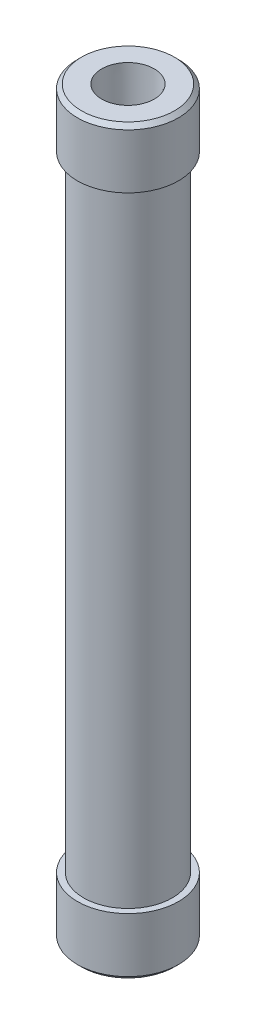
ISO-10303-21;
HEADER;
FILE_DESCRIPTION(('STEP AP214'),'2;1');
FILE_NAME('part.step','',(''),(''),'','','');
FILE_SCHEMA(('AUTOMOTIVE_DESIGN { 1 0 10303 214 1 1 1 1 }'));
ENDSEC;
DATA;
#1=APPLICATION_CONTEXT('core data for automotive mechanical design processes');
#2=APPLICATION_PROTOCOL_DEFINITION('international standard','automotive_design',2000,#1);
#3=PRODUCT_CONTEXT('',#1,'mechanical');
#4=PRODUCT('Part','Part','',(#3));
#5=PRODUCT_RELATED_PRODUCT_CATEGORY('part','',(#4));
#6=PRODUCT_DEFINITION_FORMATION('','',#4);
#7=PRODUCT_DEFINITION_CONTEXT('part definition',#1,'design');
#8=PRODUCT_DEFINITION('design','',#6,#7);
#9=PRODUCT_DEFINITION_SHAPE('','',#8);
#10=(LENGTH_UNIT() NAMED_UNIT(*) SI_UNIT(.MILLI.,.METRE.));
#11=(NAMED_UNIT(*) PLANE_ANGLE_UNIT() SI_UNIT($,.RADIAN.));
#12=(NAMED_UNIT(*) SI_UNIT($,.STERADIAN.) SOLID_ANGLE_UNIT());
#13=UNCERTAINTY_MEASURE_WITH_UNIT(LENGTH_MEASURE(1.E-05),#10,'distance_accuracy_value','');
#14=(GEOMETRIC_REPRESENTATION_CONTEXT(3) GLOBAL_UNCERTAINTY_ASSIGNED_CONTEXT((#13)) GLOBAL_UNIT_ASSIGNED_CONTEXT((#10,
#11,#12)) REPRESENTATION_CONTEXT('',''));
#15=CARTESIAN_POINT('',(0.,0.,0.));
#16=DIRECTION('',(0.,0.,1.));
#17=DIRECTION('',(1.,0.,0.));
#18=AXIS2_PLACEMENT_3D('',#15,#16,#17);
#19=CARTESIAN_POINT('',(0.,279.4,0.));
#20=DIRECTION('',(0.,-1.,0.));
#21=DIRECTION('',(0.,0.,-1.));
#22=AXIS2_PLACEMENT_3D('',#19,#20,#21);
#23=CYLINDRICAL_SURFACE('',#22,16.7005);
#24=CARTESIAN_POINT('',(0.,22.098,0.));
#25=DIRECTION('',(0.,1.,0.));
#26=DIRECTION('',(0.,0.,1.));
#27=AXIS2_PLACEMENT_3D('',#24,#25,#26);
#28=CIRCLE('',#27,16.7005);
#29=CARTESIAN_POINT('',(0.,22.098,16.7005));
#30=VERTEX_POINT('',#29);
#31=EDGE_CURVE('E76',#30,#30,#28,.T.);
#32=ORIENTED_EDGE('',*,*,#31,.T.);
#33=EDGE_LOOP('',(#32));
#34=FACE_BOUND('',#33,.T.);
#35=CARTESIAN_POINT('',(0.,257.302,0.));
#36=DIRECTION('',(0.,1.,0.));
#37=DIRECTION('',(0.,0.,1.));
#38=AXIS2_PLACEMENT_3D('',#35,#36,#37);
#39=CIRCLE('',#38,16.7005);
#40=CARTESIAN_POINT('',(0.,257.302,16.7005));
#41=VERTEX_POINT('',#40);
#42=EDGE_CURVE('E68',#41,#41,#39,.T.);
#43=ORIENTED_EDGE('',*,*,#42,.F.);
#44=EDGE_LOOP('',(#43));
#45=FACE_BOUND('',#44,.T.);
#46=ADVANCED_FACE('F33',(#34,#45),#23,.T.);
#47=CARTESIAN_POINT('',(0.,22.098,0.));
#48=DIRECTION('',(0.,1.,0.));
#49=DIRECTION('',(0.,0.,1.));
#50=AXIS2_PLACEMENT_3D('',#47,#48,#49);
#51=PLANE('',#50);
#52=CARTESIAN_POINT('',(0.,22.098,0.));
#53=DIRECTION('',(0.,1.,0.));
#54=DIRECTION('',(0.,0.,1.));
#55=AXIS2_PLACEMENT_3D('',#52,#53,#54);
#56=CIRCLE('',#55,19.05);
#57=CARTESIAN_POINT('',(0.,22.098,19.05));
#58=VERTEX_POINT('',#57);
#59=EDGE_CURVE('E73',#58,#58,#56,.T.);
#60=ORIENTED_EDGE('',*,*,#59,.T.);
#61=EDGE_LOOP('',(#60));
#62=FACE_BOUND('',#61,.T.);
#63=ORIENTED_EDGE('',*,*,#31,.F.);
#64=EDGE_LOOP('',(#63));
#65=FACE_BOUND('',#64,.T.);
#66=ADVANCED_FACE('F98',(#62,#65),#51,.T.);
#67=CARTESIAN_POINT('',(0.,22.098,0.));
#68=DIRECTION('',(0.,-1.,0.));
#69=DIRECTION('',(0.,0.,-1.));
#70=AXIS2_PLACEMENT_3D('',#67,#68,#69);
#71=CYLINDRICAL_SURFACE('',#70,19.05);
#72=CARTESIAN_POINT('',(0.,1.52399999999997,0.));
#73=DIRECTION('',(0.,1.,0.));
#74=DIRECTION('',(0.,0.,1.));
#75=AXIS2_PLACEMENT_3D('',#72,#73,#74);
#76=CIRCLE('',#75,19.05);
#77=CARTESIAN_POINT('',(0.,1.52399999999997,19.05));
#78=VERTEX_POINT('',#77);
#79=EDGE_CURVE('E71',#78,#78,#76,.T.);
#80=ORIENTED_EDGE('',*,*,#79,.T.);
#81=EDGE_LOOP('',(#80));
#82=FACE_BOUND('',#81,.T.);
#83=ORIENTED_EDGE('',*,*,#59,.F.);
#84=EDGE_LOOP('',(#83));
#85=FACE_BOUND('',#84,.T.);
#86=ADVANCED_FACE('F95',(#82,#85),#71,.T.);
#87=CARTESIAN_POINT('',(0.,0.,0.));
#88=DIRECTION('',(0.,1.,0.));
#89=DIRECTION('',(0.,0.,1.));
#90=AXIS2_PLACEMENT_3D('',#87,#88,#89);
#91=PLANE('',#90);
#92=CARTESIAN_POINT('',(0.,0.,0.));
#93=DIRECTION('',(0.,-1.,0.));
#94=DIRECTION('',(0.,0.,-1.));
#95=AXIS2_PLACEMENT_3D('',#92,#93,#94);
#96=CIRCLE('',#95,9.896063);
#97=CARTESIAN_POINT('',(0.,0.,-9.896063));
#98=VERTEX_POINT('',#97);
#99=EDGE_CURVE('E64',#98,#98,#96,.T.);
#100=ORIENTED_EDGE('',*,*,#99,.F.);
#101=EDGE_LOOP('',(#100));
#102=FACE_BOUND('',#101,.T.);
#103=CARTESIAN_POINT('',(0.,0.,0.));
#104=DIRECTION('',(0.,1.,0.));
#105=DIRECTION('',(0.,0.,1.));
#106=AXIS2_PLACEMENT_3D('',#103,#104,#105);
#107=CIRCLE('',#106,17.526);
#108=CARTESIAN_POINT('',(0.,0.,17.526));
#109=VERTEX_POINT('',#108);
#110=EDGE_CURVE('E46',#109,#109,#107,.F.);
#111=ORIENTED_EDGE('',*,*,#110,.T.);
#112=EDGE_LOOP('',(#111));
#113=FACE_BOUND('',#112,.T.);
#114=ADVANCED_FACE('F87',(#102,#113),#91,.F.);
#115=CARTESIAN_POINT('',(0.,257.302,0.));
#116=DIRECTION('',(0.,1.,0.));
#117=DIRECTION('',(0.,0.,1.));
#118=AXIS2_PLACEMENT_3D('',#115,#116,#117);
#119=PLANE('',#118);
#120=CARTESIAN_POINT('',(0.,257.302,0.));
#121=DIRECTION('',(0.,1.,0.));
#122=DIRECTION('',(0.,0.,1.));
#123=AXIS2_PLACEMENT_3D('',#120,#121,#122);
#124=CIRCLE('',#123,19.05);
#125=CARTESIAN_POINT('',(0.,257.302,19.05));
#126=VERTEX_POINT('',#125);
#127=EDGE_CURVE('E51',#126,#126,#124,.T.);
#128=ORIENTED_EDGE('',*,*,#127,.F.);
#129=EDGE_LOOP('',(#128));
#130=FACE_BOUND('',#129,.T.);
#131=ORIENTED_EDGE('',*,*,#42,.T.);
#132=EDGE_LOOP('',(#131));
#133=FACE_BOUND('',#132,.T.);
#134=ADVANCED_FACE('F113',(#130,#133),#119,.F.);
#135=CARTESIAN_POINT('',(0.,257.302,0.));
#136=DIRECTION('',(0.,1.,0.));
#137=DIRECTION('',(0.,0.,1.));
#138=AXIS2_PLACEMENT_3D('',#135,#136,#137);
#139=CYLINDRICAL_SURFACE('',#138,19.05);
#140=CARTESIAN_POINT('',(0.,277.876,0.));
#141=DIRECTION('',(0.,1.,0.));
#142=DIRECTION('',(0.,0.,1.));
#143=AXIS2_PLACEMENT_3D('',#140,#141,#142);
#144=CIRCLE('',#143,19.05);
#145=CARTESIAN_POINT('',(0.,277.876,19.05));
#146=VERTEX_POINT('',#145);
#147=EDGE_CURVE('E10',#146,#146,#144,.F.);
#148=ORIENTED_EDGE('',*,*,#147,.T.);
#149=EDGE_LOOP('',(#148));
#150=FACE_BOUND('',#149,.T.);
#151=ORIENTED_EDGE('',*,*,#127,.T.);
#152=EDGE_LOOP('',(#151));
#153=FACE_BOUND('',#152,.T.);
#154=ADVANCED_FACE('F115',(#150,#153),#139,.T.);
#155=CARTESIAN_POINT('',(0.,279.4,0.));
#156=DIRECTION('',(0.,1.,0.));
#157=DIRECTION('',(0.,0.,1.));
#158=AXIS2_PLACEMENT_3D('',#155,#156,#157);
#159=PLANE('',#158);
#160=CARTESIAN_POINT('',(0.,279.4,0.));
#161=DIRECTION('',(0.,1.,0.));
#162=DIRECTION('',(0.,0.,1.));
#163=AXIS2_PLACEMENT_3D('',#160,#161,#162);
#164=CIRCLE('',#163,9.896063);
#165=CARTESIAN_POINT('',(0.,279.4,9.896063));
#166=VERTEX_POINT('',#165);
#167=EDGE_CURVE('E154',#166,#166,#164,.T.);
#168=ORIENTED_EDGE('',*,*,#167,.F.);
#169=EDGE_LOOP('',(#168));
#170=FACE_BOUND('',#169,.T.);
#171=CARTESIAN_POINT('',(0.,279.4,0.));
#172=DIRECTION('',(0.,1.,0.));
#173=DIRECTION('',(0.,0.,1.));
#174=AXIS2_PLACEMENT_3D('',#171,#172,#173);
#175=CIRCLE('',#174,17.526);
#176=CARTESIAN_POINT('',(0.,279.4,17.526));
#177=VERTEX_POINT('',#176);
#178=EDGE_CURVE('E41',#177,#177,#175,.T.);
#179=ORIENTED_EDGE('',*,*,#178,.T.);
#180=EDGE_LOOP('',(#179));
#181=FACE_BOUND('',#180,.T.);
#182=ADVANCED_FACE('F92',(#170,#181),#159,.T.);
#183=CARTESIAN_POINT('',(0.,1.52399999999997,0.));
#184=DIRECTION('',(0.,1.,0.));
#185=DIRECTION('',(0.,0.,1.));
#186=AXIS2_PLACEMENT_3D('',#183,#184,#185);
#187=CONICAL_SURFACE('',#186,19.05,0.785398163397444);
#188=CARTESIAN_POINT('',(0.,0.,17.526));
#189=CARTESIAN_POINT('',(0.,0.0158749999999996,17.541875));
#190=CARTESIAN_POINT('',(0.,0.0317499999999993,17.55775));
#191=CARTESIAN_POINT('',(0.,0.0634999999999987,17.5895));
#192=CARTESIAN_POINT('',(0.,0.0793749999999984,17.605375));
#193=CARTESIAN_POINT('',(0.,0.111124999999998,17.637125));
#194=CARTESIAN_POINT('',(0.,0.126999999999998,17.653));
#195=CARTESIAN_POINT('',(0.,0.158749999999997,17.68475));
#196=CARTESIAN_POINT('',(0.,0.174624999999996,17.700625));
#197=CARTESIAN_POINT('',(0.,0.206374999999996,17.732375));
#198=CARTESIAN_POINT('',(0.,0.222249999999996,17.74825));
#199=CARTESIAN_POINT('',(0.,0.253999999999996,17.78));
#200=CARTESIAN_POINT('',(0.,0.269874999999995,17.795875));
#201=CARTESIAN_POINT('',(0.,0.301624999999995,17.827625));
#202=CARTESIAN_POINT('',(0.,0.317499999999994,17.8435));
#203=CARTESIAN_POINT('',(0.,0.349249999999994,17.87525));
#204=CARTESIAN_POINT('',(0.,0.365124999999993,17.891125));
#205=CARTESIAN_POINT('',(0.,0.396874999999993,17.922875));
#206=CARTESIAN_POINT('',(0.,0.412749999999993,17.93875));
#207=CARTESIAN_POINT('',(0.,0.444499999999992,17.9705));
#208=CARTESIAN_POINT('',(0.,0.460374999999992,17.986375));
#209=CARTESIAN_POINT('',(0.,0.492124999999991,18.018125));
#210=CARTESIAN_POINT('',(0.,0.507999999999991,18.034));
#211=CARTESIAN_POINT('',(0.,0.53974999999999,18.06575));
#212=CARTESIAN_POINT('',(0.,0.55562499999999,18.081625));
#213=CARTESIAN_POINT('',(0.,0.58737499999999,18.113375));
#214=CARTESIAN_POINT('',(0.,0.603249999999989,18.12925));
#215=CARTESIAN_POINT('',(0.,0.634999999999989,18.161));
#216=CARTESIAN_POINT('',(0.,0.650874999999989,18.176875));
#217=CARTESIAN_POINT('',(0.,0.682624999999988,18.208625));
#218=CARTESIAN_POINT('',(0.,0.698499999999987,18.2245));
#219=CARTESIAN_POINT('',(0.,0.730249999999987,18.25625));
#220=CARTESIAN_POINT('',(0.,0.746124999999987,18.272125));
#221=CARTESIAN_POINT('',(0.,0.777874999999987,18.303875));
#222=CARTESIAN_POINT('',(0.,0.793749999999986,18.31975));
#223=CARTESIAN_POINT('',(0.,0.825499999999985,18.3515));
#224=CARTESIAN_POINT('',(0.,0.841374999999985,18.367375));
#225=CARTESIAN_POINT('',(0.,0.873124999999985,18.399125));
#226=CARTESIAN_POINT('',(0.,0.888999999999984,18.415));
#227=CARTESIAN_POINT('',(0.,0.920749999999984,18.44675));
#228=CARTESIAN_POINT('',(0.,0.936624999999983,18.462625));
#229=CARTESIAN_POINT('',(0.,0.968374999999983,18.494375));
#230=CARTESIAN_POINT('',(0.,0.984249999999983,18.51025));
#231=CARTESIAN_POINT('',(0.,1.01599999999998,18.542));
#232=CARTESIAN_POINT('',(0.,1.03187499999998,18.557875));
#233=CARTESIAN_POINT('',(0.,1.06362499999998,18.589625));
#234=CARTESIAN_POINT('',(0.,1.07949999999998,18.6055));
#235=CARTESIAN_POINT('',(0.,1.11124999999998,18.63725));
#236=CARTESIAN_POINT('',(0.,1.12712499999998,18.653125));
#237=CARTESIAN_POINT('',(0.,1.15887499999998,18.684875));
#238=CARTESIAN_POINT('',(0.,1.17474999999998,18.70075));
#239=CARTESIAN_POINT('',(0.,1.20649999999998,18.7325));
#240=CARTESIAN_POINT('',(0.,1.22237499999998,18.748375));
#241=CARTESIAN_POINT('',(0.,1.25412499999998,18.780125));
#242=CARTESIAN_POINT('',(0.,1.26999999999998,18.796));
#243=CARTESIAN_POINT('',(0.,1.30174999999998,18.82775));
#244=CARTESIAN_POINT('',(0.,1.31762499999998,18.843625));
#245=CARTESIAN_POINT('',(0.,1.34937499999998,18.875375));
#246=CARTESIAN_POINT('',(0.,1.36524999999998,18.89125));
#247=CARTESIAN_POINT('',(0.,1.39699999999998,18.923));
#248=CARTESIAN_POINT('',(0.,1.41287499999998,18.938875));
#249=CARTESIAN_POINT('',(0.,1.44462499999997,18.970625));
#250=CARTESIAN_POINT('',(0.,1.46049999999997,18.9865));
#251=CARTESIAN_POINT('',(0.,1.49224999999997,19.01825));
#252=CARTESIAN_POINT('',(0.,1.50812499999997,19.034125));
#253=CARTESIAN_POINT('',(0.,1.52399999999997,19.05));
#254=B_SPLINE_CURVE_WITH_KNOTS('',3,(#188,#189,#190,#191,#192,#193,#194,#195,#196,#197,#198,
#199,#200,#201,#202,#203,#204,#205,#206,#207,#208,#209,#210,#211,#212,#213,#214,#215,#216,#217,
#218,#219,#220,#221,#222,#223,#224,#225,#226,#227,#228,#229,#230,#231,#232,#233,#234,#235,#236,
#237,#238,#239,#240,#241,#242,#243,#244,#245,#246,#247,#248,#249,#250,#251,#252,#253),
.UNSPECIFIED.,.F.,.F.,(4,2,2,2,2,2,2,2,2,2,2,2,2,2,2,2,2,2,2,2,2,2,2,2,2,2,2,2,2,2,2,2,4),(0.,
0.0673519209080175,0.134703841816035,0.202055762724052,0.26940768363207,0.336759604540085,
0.404111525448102,0.471463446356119,0.538815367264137,0.606167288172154,0.673519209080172,
0.740871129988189,0.808223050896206,0.875574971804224,0.942926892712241,1.01027881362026,
1.07763073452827,1.14498265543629,1.21233457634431,1.27968649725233,1.34703841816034,
1.41439033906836,1.48174225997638,1.5490941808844,1.61644610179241,1.68379802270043,
1.75114994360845,1.81850186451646,1.88585378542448,1.9532057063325,2.02055762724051,
2.08790954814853,2.15526146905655),.UNSPECIFIED.);
#255=EDGE_CURVE('BSEAM89',#109,#78,#254,.T.);
#256=ORIENTED_EDGE('',*,*,#110,.F.);
#257=ORIENTED_EDGE('',*,*,#79,.F.);
#258=ORIENTED_EDGE('',*,*,#255,.T.);
#259=ORIENTED_EDGE('',*,*,#255,.F.);
#260=EDGE_LOOP('',(#256,#258,#257,#259));
#261=FACE_BOUND('',#260,.T.);
#262=ADVANCED_FACE('F89',(#261),#187,.T.);
#263=CARTESIAN_POINT('',(0.,279.4,0.));
#264=DIRECTION('',(0.,-1.,0.));
#265=DIRECTION('',(0.,0.,-1.));
#266=AXIS2_PLACEMENT_3D('',#263,#264,#265);
#267=CONICAL_SURFACE('',#266,17.526,0.785398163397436);
#268=ORIENTED_EDGE('',*,*,#147,.F.);
#269=EDGE_LOOP('',(#268));
#270=FACE_BOUND('',#269,.T.);
#271=ORIENTED_EDGE('',*,*,#178,.F.);
#272=EDGE_LOOP('',(#271));
#273=FACE_BOUND('',#272,.T.);
#274=ADVANCED_FACE('F35',(#270,#273),#267,.T.);
#275=CARTESIAN_POINT('',(0.,0.,0.));
#276=DIRECTION('',(0.,-1.,0.));
#277=DIRECTION('',(0.,0.,-1.));
#278=AXIS2_PLACEMENT_3D('',#275,#276,#277);
#279=CYLINDRICAL_SURFACE('',#278,8.75);
#280=CARTESIAN_POINT('',(0.,22.098,0.));
#281=DIRECTION('',(0.,1.,0.));
#282=DIRECTION('',(0.,0.,1.));
#283=AXIS2_PLACEMENT_3D('',#280,#281,#282);
#284=CIRCLE('',#283,8.75);
#285=CARTESIAN_POINT('',(0.,22.098,8.75));
#286=VERTEX_POINT('',#285);
#287=EDGE_CURVE('E49',#286,#286,#284,.T.);
#288=ORIENTED_EDGE('',*,*,#287,.T.);
#289=EDGE_LOOP('',(#288));
#290=FACE_BOUND('',#289,.T.);
#291=CARTESIAN_POINT('',(0.,14.986,0.));
#292=DIRECTION('',(0.,-1.,0.));
#293=DIRECTION('',(0.,0.,-1.));
#294=AXIS2_PLACEMENT_3D('',#291,#292,#293);
#295=CIRCLE('',#294,8.75);
#296=CARTESIAN_POINT('',(0.,14.986,-8.75));
#297=VERTEX_POINT('',#296);
#298=EDGE_CURVE('E52',#297,#297,#295,.T.);
#299=ORIENTED_EDGE('',*,*,#298,.T.);
#300=EDGE_LOOP('',(#299));
#301=FACE_BOUND('',#300,.T.);
#302=ADVANCED_FACE('F168',(#290,#301),#279,.F.);
#303=CARTESIAN_POINT('',(8.75,14.986,0.));
#304=DIRECTION('',(0.,1.,0.));
#305=DIRECTION('',(0.,0.,1.));
#306=AXIS2_PLACEMENT_3D('',#303,#304,#305);
#307=PLANE('',#306);
#308=ORIENTED_EDGE('',*,*,#298,.F.);
#309=EDGE_LOOP('',(#308));
#310=FACE_BOUND('',#309,.T.);
#311=CARTESIAN_POINT('',(0.,14.986,0.));
#312=DIRECTION('',(0.,-1.,0.));
#313=DIRECTION('',(0.,0.,-1.));
#314=AXIS2_PLACEMENT_3D('',#311,#312,#313);
#315=CIRCLE('',#314,9.42825071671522);
#316=CARTESIAN_POINT('',(0.,14.986,-9.42825071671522));
#317=VERTEX_POINT('',#316);
#318=EDGE_CURVE('E59',#317,#317,#315,.T.);
#319=ORIENTED_EDGE('',*,*,#318,.T.);
#320=EDGE_LOOP('',(#319));
#321=FACE_BOUND('',#320,.T.);
#322=ADVANCED_FACE('F173',(#310,#321),#307,.F.);
#323=CARTESIAN_POINT('',(0.,0.,0.));
#324=DIRECTION('',(0.,-1.,0.));
#325=DIRECTION('',(0.,0.,-1.));
#326=AXIS2_PLACEMENT_3D('',#323,#324,#325);
#327=CONICAL_SURFACE('',#326,9.896063,0.0312064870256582);
#328=ORIENTED_EDGE('',*,*,#318,.F.);
#329=EDGE_LOOP('',(#328));
#330=FACE_BOUND('',#329,.T.);
#331=ORIENTED_EDGE('',*,*,#99,.T.);
#332=EDGE_LOOP('',(#331));
#333=FACE_BOUND('',#332,.T.);
#334=ADVANCED_FACE('F177',(#330,#333),#327,.F.);
#335=ORIENTED_EDGE('',*,*,#287,.F.);
#336=EDGE_LOOP('',(#335));
#337=FACE_BOUND('',#336,.T.);
#338=CARTESIAN_POINT('',(0.,22.098,0.));
#339=DIRECTION('',(0.,1.,0.));
#340=DIRECTION('',(0.,0.,1.));
#341=AXIS2_PLACEMENT_3D('',#338,#339,#340);
#342=CIRCLE('',#341,13.1445);
#343=CARTESIAN_POINT('',(0.,22.098,13.1445));
#344=VERTEX_POINT('',#343);
#345=EDGE_CURVE('E72',#344,#344,#342,.T.);
#346=ORIENTED_EDGE('',*,*,#345,.T.);
#347=EDGE_LOOP('',(#346));
#348=FACE_BOUND('',#347,.T.);
#349=ADVANCED_FACE('F105',(#337,#348),#51,.T.);
#350=CARTESIAN_POINT('',(0.,279.4,0.));
#351=DIRECTION('',(0.,-1.,0.));
#352=DIRECTION('',(0.,0.,-1.));
#353=AXIS2_PLACEMENT_3D('',#350,#351,#352);
#354=CYLINDRICAL_SURFACE('',#353,13.1445);
#355=ORIENTED_EDGE('',*,*,#345,.F.);
#356=EDGE_LOOP('',(#355));
#357=FACE_BOUND('',#356,.T.);
#358=CARTESIAN_POINT('',(0.,257.302,0.));
#359=DIRECTION('',(0.,1.,0.));
#360=DIRECTION('',(0.,0.,1.));
#361=AXIS2_PLACEMENT_3D('',#358,#359,#360);
#362=CIRCLE('',#361,13.1445);
#363=CARTESIAN_POINT('',(0.,257.302,13.1445));
#364=VERTEX_POINT('',#363);
#365=EDGE_CURVE('E56',#364,#364,#362,.T.);
#366=ORIENTED_EDGE('',*,*,#365,.T.);
#367=EDGE_LOOP('',(#366));
#368=FACE_BOUND('',#367,.T.);
#369=ADVANCED_FACE('F130',(#357,#368),#354,.F.);
#370=CARTESIAN_POINT('',(0.,257.302,0.));
#371=DIRECTION('',(0.,1.,0.));
#372=DIRECTION('',(0.,0.,1.));
#373=AXIS2_PLACEMENT_3D('',#370,#371,#372);
#374=CIRCLE('',#373,8.75);
#375=CARTESIAN_POINT('',(0.,257.302,8.75));
#376=VERTEX_POINT('',#375);
#377=EDGE_CURVE('E37',#376,#376,#374,.T.);
#378=ORIENTED_EDGE('',*,*,#377,.T.);
#379=EDGE_LOOP('',(#378));
#380=FACE_BOUND('',#379,.T.);
#381=ORIENTED_EDGE('',*,*,#365,.F.);
#382=EDGE_LOOP('',(#381));
#383=FACE_BOUND('',#382,.T.);
#384=ADVANCED_FACE('F118',(#380,#383),#119,.F.);
#385=CARTESIAN_POINT('',(0.,279.4,0.));
#386=DIRECTION('',(0.,1.,0.));
#387=DIRECTION('',(0.,0.,1.));
#388=AXIS2_PLACEMENT_3D('',#385,#386,#387);
#389=CYLINDRICAL_SURFACE('',#388,8.75);
#390=CARTESIAN_POINT('',(0.,264.414,0.));
#391=DIRECTION('',(0.,1.,0.));
#392=DIRECTION('',(0.,0.,1.));
#393=AXIS2_PLACEMENT_3D('',#390,#391,#392);
#394=CIRCLE('',#393,8.75);
#395=CARTESIAN_POINT('',(0.,264.414,8.75));
#396=VERTEX_POINT('',#395);
#397=EDGE_CURVE('E147',#396,#396,#394,.T.);
#398=ORIENTED_EDGE('',*,*,#397,.T.);
#399=EDGE_LOOP('',(#398));
#400=FACE_BOUND('',#399,.T.);
#401=ORIENTED_EDGE('',*,*,#377,.F.);
#402=EDGE_LOOP('',(#401));
#403=FACE_BOUND('',#402,.T.);
#404=ADVANCED_FACE('F129',(#400,#403),#389,.F.);
#405=CARTESIAN_POINT('',(8.75,264.414,0.));
#406=DIRECTION('',(0.,-1.,0.));
#407=DIRECTION('',(0.,0.,-1.));
#408=AXIS2_PLACEMENT_3D('',#405,#406,#407);
#409=PLANE('',#408);
#410=ORIENTED_EDGE('',*,*,#397,.F.);
#411=EDGE_LOOP('',(#410));
#412=FACE_BOUND('',#411,.T.);
#413=CARTESIAN_POINT('',(0.,264.414,0.));
#414=DIRECTION('',(0.,1.,0.));
#415=DIRECTION('',(0.,0.,1.));
#416=AXIS2_PLACEMENT_3D('',#413,#414,#415);
#417=CIRCLE('',#416,9.42825071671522);
#418=CARTESIAN_POINT('',(0.,264.414,9.42825071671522));
#419=VERTEX_POINT('',#418);
#420=EDGE_CURVE('E150',#419,#419,#417,.T.);
#421=ORIENTED_EDGE('',*,*,#420,.T.);
#422=EDGE_LOOP('',(#421));
#423=FACE_BOUND('',#422,.T.);
#424=ADVANCED_FACE('F136',(#412,#423),#409,.F.);
#425=CARTESIAN_POINT('',(0.,279.4,0.));
#426=DIRECTION('',(0.,1.,0.));
#427=DIRECTION('',(0.,0.,1.));
#428=AXIS2_PLACEMENT_3D('',#425,#426,#427);
#429=CONICAL_SURFACE('',#428,9.896063,0.0312064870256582);
#430=ORIENTED_EDGE('',*,*,#420,.F.);
#431=EDGE_LOOP('',(#430));
#432=FACE_BOUND('',#431,.T.);
#433=ORIENTED_EDGE('',*,*,#167,.T.);
#434=EDGE_LOOP('',(#433));
#435=FACE_BOUND('',#434,.T.);
#436=ADVANCED_FACE('F160',(#432,#435),#429,.F.);
#437=CLOSED_SHELL('',(#46,#66,#86,#114,#134,#154,#182,#262,#274,#302,#322,#334,#349,#369,#384,
#404,#424,#436));
#438=MANIFOLD_SOLID_BREP('B2',#437);
#439=ADVANCED_BREP_SHAPE_REPRESENTATION('',(#18,#438),#14);
#440=SHAPE_DEFINITION_REPRESENTATION(#9,#439);
ENDSEC;
END-ISO-10303-21;
